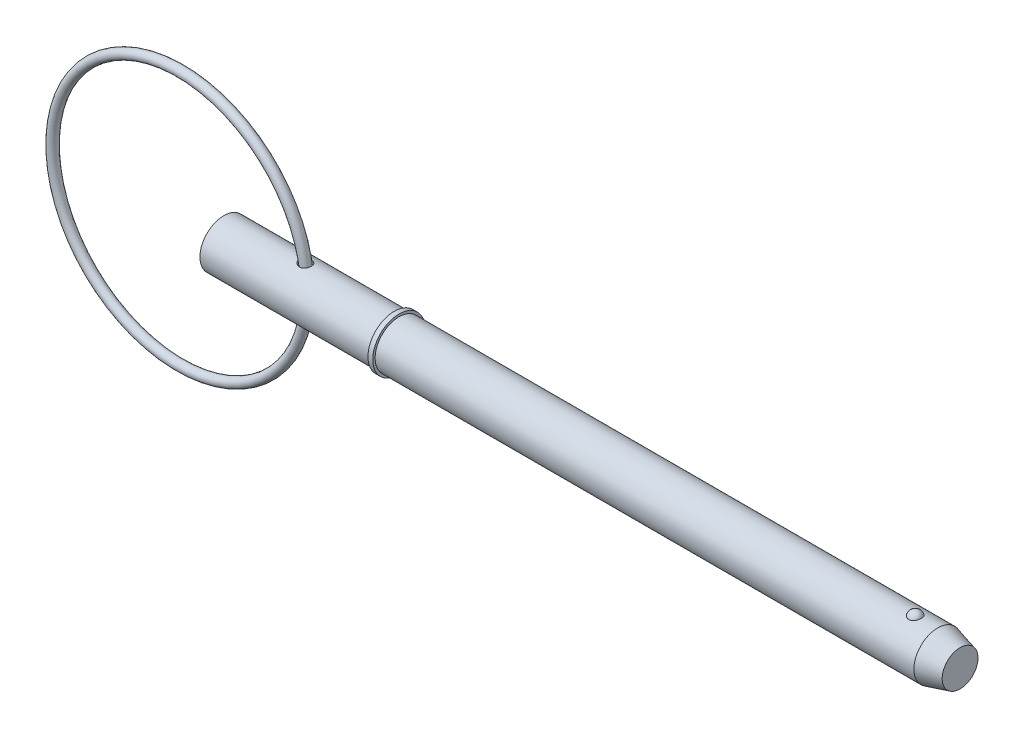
ISO-10303-21;
HEADER;
FILE_DESCRIPTION(('STEP AP214'),'2;1');
FILE_NAME('part.step','',(''),(''),'','','');
FILE_SCHEMA(('AUTOMOTIVE_DESIGN { 1 0 10303 214 1 1 1 1 }'));
ENDSEC;
DATA;
#1=APPLICATION_CONTEXT('core data for automotive mechanical design processes');
#2=APPLICATION_PROTOCOL_DEFINITION('international standard','automotive_design',2000,#1);
#3=PRODUCT_CONTEXT('',#1,'mechanical');
#4=PRODUCT('Part','Part','',(#3));
#5=PRODUCT_RELATED_PRODUCT_CATEGORY('part','',(#4));
#6=PRODUCT_DEFINITION_FORMATION('','',#4);
#7=PRODUCT_DEFINITION_CONTEXT('part definition',#1,'design');
#8=PRODUCT_DEFINITION('design','',#6,#7);
#9=PRODUCT_DEFINITION_SHAPE('','',#8);
#10=(LENGTH_UNIT() NAMED_UNIT(*) SI_UNIT(.MILLI.,.METRE.));
#11=(NAMED_UNIT(*) PLANE_ANGLE_UNIT() SI_UNIT($,.RADIAN.));
#12=(NAMED_UNIT(*) SI_UNIT($,.STERADIAN.) SOLID_ANGLE_UNIT());
#13=UNCERTAINTY_MEASURE_WITH_UNIT(LENGTH_MEASURE(1.E-05),#10,'distance_accuracy_value','');
#14=(GEOMETRIC_REPRESENTATION_CONTEXT(3) GLOBAL_UNCERTAINTY_ASSIGNED_CONTEXT((#13)) GLOBAL_UNIT_ASSIGNED_CONTEXT((#10,
#11,#12)) REPRESENTATION_CONTEXT('',''));
#15=CARTESIAN_POINT('',(0.,0.,0.));
#16=DIRECTION('',(0.,0.,1.));
#17=DIRECTION('',(1.,0.,0.));
#18=AXIS2_PLACEMENT_3D('',#15,#16,#17);
#19=CARTESIAN_POINT('',(-4.3552379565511,0.,0.));
#20=DIRECTION('',(0.,0.,1.));
#21=DIRECTION('',(1.,0.,0.));
#22=AXIS2_PLACEMENT_3D('',#19,#20,#21);
#23=TOROIDAL_SURFACE('',#22,12.7,0.476000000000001);
#24=CARTESIAN_POINT('',(8.8207620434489,0.,0.));
#25=VERTEX_POINT('',#24);
#26=VERTEX_LOOP('',#25);
#27=FACE_BOUND('',#26,.T.);
#28=ADVANCED_FACE('P0_F12',(#27),#23,.T.);
#29=CLOSED_SHELL('',(#28));
#30=MANIFOLD_SOLID_BREP('P0_B1',#29);
#31=CARTESIAN_POINT('',(0.,0.,0.));
#32=DIRECTION('',(1.,0.,0.));
#33=DIRECTION('',(0.,0.,-1.));
#34=AXIS2_PLACEMENT_3D('',#31,#32,#33);
#35=CYLINDRICAL_SURFACE('',#34,2.38);
#36=CARTESIAN_POINT('',(7.58975148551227,2.36313886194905,-0.28279801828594));
#37=CARTESIAN_POINT('',(7.6071494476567,2.3595137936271,-0.313086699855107));
#38=CARTESIAN_POINT('',(7.62722970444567,2.35548219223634,-0.341811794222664));
#39=CARTESIAN_POINT('',(7.6719764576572,2.34708028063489,-0.395416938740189));
#40=CARTESIAN_POINT('',(7.69665038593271,2.34270942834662,-0.420290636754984));
#41=CARTESIAN_POINT('',(7.74972661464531,2.33413422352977,-0.465561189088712));
#42=CARTESIAN_POINT('',(7.77811964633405,2.3299294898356,-0.485968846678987));
#43=CARTESIAN_POINT('',(7.83790446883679,2.32214293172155,-0.521911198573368));
#44=CARTESIAN_POINT('',(7.86929545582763,2.31856094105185,-0.537447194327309));
#45=CARTESIAN_POINT('',(7.93519088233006,2.31234960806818,-0.563583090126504));
#46=CARTESIAN_POINT('',(7.96975762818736,2.30974952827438,-0.574033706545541));
#47=CARTESIAN_POINT('',(8.04024488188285,2.3060008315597,-0.588914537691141));
#48=CARTESIAN_POINT('',(8.07616512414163,2.3048519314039,-0.593345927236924));
#49=CARTESIAN_POINT('',(8.14695871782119,2.30420789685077,-0.595841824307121));
#50=CARTESIAN_POINT('',(8.18182355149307,2.30465507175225,-0.594128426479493));
#51=CARTESIAN_POINT('',(8.25068512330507,2.30705630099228,-0.584734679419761));
#52=CARTESIAN_POINT('',(8.28468213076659,2.30900988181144,-0.577056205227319));
#53=CARTESIAN_POINT('',(8.34906698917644,2.31406811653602,-0.556412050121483));
#54=CARTESIAN_POINT('',(8.37955021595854,2.31711087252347,-0.543727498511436));
#55=CARTESIAN_POINT('',(8.43786372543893,2.32400968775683,-0.513438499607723));
#56=CARTESIAN_POINT('',(8.46569411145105,2.32786571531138,-0.495834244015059));
#57=CARTESIAN_POINT('',(8.51768626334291,2.33591620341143,-0.456393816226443));
#58=CARTESIAN_POINT('',(8.54188060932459,2.34010706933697,-0.434599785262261));
#59=CARTESIAN_POINT('',(8.58630752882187,2.34840208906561,-0.387277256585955));
#60=CARTESIAN_POINT('',(8.60653982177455,2.35250623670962,-0.361748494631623));
#61=CARTESIAN_POINT('',(8.64282785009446,2.36024850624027,-0.307237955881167));
#62=CARTESIAN_POINT('',(8.65881497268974,2.36387854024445,-0.278209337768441));
#63=CARTESIAN_POINT('',(8.68580879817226,2.37020506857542,-0.217827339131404));
#64=CARTESIAN_POINT('',(8.69681534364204,2.37290153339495,-0.18647388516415));
#65=CARTESIAN_POINT('',(8.71363969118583,2.37708738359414,-0.122079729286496));
#66=CARTESIAN_POINT('',(8.71941899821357,2.37856780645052,-0.0890283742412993));
#67=CARTESIAN_POINT('',(8.72550469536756,2.38012793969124,-0.0223933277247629));
#68=CARTESIAN_POINT('',(8.72581115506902,2.38020766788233,0.0111903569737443));
#69=CARTESIAN_POINT('',(8.72094957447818,2.37895941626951,0.0778527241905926));
#70=CARTESIAN_POINT('',(8.71579439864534,2.377634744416,0.110932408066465));
#71=CARTESIAN_POINT('',(8.70015845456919,2.37372548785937,0.175731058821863));
#72=CARTESIAN_POINT('',(8.68967753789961,2.37114086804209,0.207449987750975));
#73=CARTESIAN_POINT('',(8.66363496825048,2.36498751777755,0.268667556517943));
#74=CARTESIAN_POINT('',(8.64806773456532,2.36141770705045,0.298163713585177));
#75=CARTESIAN_POINT('',(8.61223946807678,2.35368505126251,0.354067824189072));
#76=CARTESIAN_POINT('',(8.59197833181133,2.34952219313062,0.380475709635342));
#77=CARTESIAN_POINT('',(8.54726357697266,2.34106443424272,0.429460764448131));
#78=CARTESIAN_POINT('',(8.52280850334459,2.33676948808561,0.452036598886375));
#79=CARTESIAN_POINT('',(8.47035669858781,2.3285376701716,0.49269040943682));
#80=CARTESIAN_POINT('',(8.44236041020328,2.32460075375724,0.510768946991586));
#81=CARTESIAN_POINT('',(8.38398546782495,2.31758529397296,0.541708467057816));
#82=CARTESIAN_POINT('',(8.35364184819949,2.31449641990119,0.554633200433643));
#83=CARTESIAN_POINT('',(8.29114127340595,2.30945817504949,0.575253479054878));
#84=CARTESIAN_POINT('',(8.25898451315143,2.30750868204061,0.582949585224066));
#85=CARTESIAN_POINT('',(8.19412910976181,2.30496641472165,0.592921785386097));
#86=CARTESIAN_POINT('',(8.161439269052,2.30436008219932,0.595252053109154));
#87=CARTESIAN_POINT('',(8.09610955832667,2.30450130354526,0.594704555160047));
#88=CARTESIAN_POINT('',(8.0634696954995,2.30524903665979,0.591826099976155));
#89=CARTESIAN_POINT('',(7.99825736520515,2.30802121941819,0.580921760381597));
#90=CARTESIAN_POINT('',(7.96570822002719,2.31007800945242,0.572765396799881));
#91=CARTESIAN_POINT('',(7.90235775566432,2.31524655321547,0.551500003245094));
#92=CARTESIAN_POINT('',(7.87155698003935,2.31835863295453,0.53838944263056));
#93=CARTESIAN_POINT('',(7.81084906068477,2.32548378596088,0.506755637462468));
#94=CARTESIAN_POINT('',(7.78107737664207,2.32953608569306,0.487980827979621));
#95=CARTESIAN_POINT('',(7.72506412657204,2.33797565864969,0.445793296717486));
#96=CARTESIAN_POINT('',(7.69882353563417,2.34236302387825,0.422379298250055));
#97=CARTESIAN_POINT('',(7.65019002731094,2.35106473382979,0.370927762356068));
#98=CARTESIAN_POINT('',(7.62788209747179,2.35537598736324,0.342808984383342));
#99=CARTESIAN_POINT('',(7.58861130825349,2.36331071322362,0.282967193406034));
#100=CARTESIAN_POINT('',(7.57164595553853,2.3669345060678,0.251245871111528));
#101=CARTESIAN_POINT('',(7.54465876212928,2.37284705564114,0.187017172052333));
#102=CARTESIAN_POINT('',(7.5342924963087,2.37520082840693,0.154660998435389));
#103=CARTESIAN_POINT('',(7.51954252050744,2.37858198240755,0.0885446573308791));
#104=CARTESIAN_POINT('',(7.51515589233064,2.37961001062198,0.0547851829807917));
#105=CARTESIAN_POINT('',(7.51270681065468,2.38018226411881,-0.0102367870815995));
#106=CARTESIAN_POINT('',(7.51416323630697,2.37983937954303,-0.0414812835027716));
#107=CARTESIAN_POINT('',(7.52225907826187,2.37796025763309,-0.103234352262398));
#108=CARTESIAN_POINT('',(7.52889419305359,2.37642501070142,-0.133743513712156));
#109=CARTESIAN_POINT('',(7.54430841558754,2.37294751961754,-0.184277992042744));
#110=CARTESIAN_POINT('',(7.55185254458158,2.37126438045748,-0.204709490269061));
#111=CARTESIAN_POINT('',(7.56916989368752,2.36748607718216,-0.244561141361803));
#112=CARTESIAN_POINT('',(7.57894307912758,2.36539091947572,-0.263981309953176));
#113=CARTESIAN_POINT('',(7.58975148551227,2.36313886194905,-0.28279801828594));
#114=B_SPLINE_CURVE_WITH_KNOTS('',3,(#36,#37,#38,#39,#40,#41,#42,#43,#44,#45,#46,#47,#48,#49,
#50,#51,#52,#53,#54,#55,#56,#57,#58,#59,#60,#61,#62,#63,#64,#65,#66,#67,#68,#69,#70,#71,#72,#73,
#74,#75,#76,#77,#78,#79,#80,#81,#82,#83,#84,#85,#86,#87,#88,#89,#90,#91,#92,#93,#94,#95,#96,#97,
#98,#99,#100,#101,#102,#103,#104,#105,#106,#107,#108,#109,#110,#111,#112,#113),.UNSPECIFIED.,
.T.,.F.,(4,2,2,2,2,2,2,2,2,2,2,2,2,2,2,2,2,2,2,2,2,2,2,2,2,2,2,2,2,2,2,2,2,2,2,2,2,2,4),(0.,
0.105267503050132,0.210706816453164,0.315888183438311,0.421041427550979,0.529118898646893,
0.637175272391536,0.741366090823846,0.84552417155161,0.944516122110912,1.04350421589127,
1.14154435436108,1.23959143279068,1.33913812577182,1.43868796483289,1.53896508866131,
1.63924093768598,1.73928111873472,1.83932408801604,1.93947719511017,2.03963250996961,
2.13982264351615,2.24000026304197,2.33889712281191,2.43778337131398,2.53566679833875,
2.63356318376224,2.73397729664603,2.83442245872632,2.94022921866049,3.04606513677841,
3.15396441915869,3.26181327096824,3.36343346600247,3.46500405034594,3.55839004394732,
3.65169855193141,3.71709653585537,3.78249350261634),.UNSPECIFIED.);
#115=CARTESIAN_POINT('',(7.58975148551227,2.36313886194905,-0.28279801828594));
#116=VERTEX_POINT('',#115);
#117=EDGE_CURVE('P1_E42',#116,#116,#114,.T.);
#118=ORIENTED_EDGE('',*,*,#117,.T.);
#119=EDGE_LOOP('',(#118));
#120=FACE_BOUND('',#119,.T.);
#121=CARTESIAN_POINT('',(0.,0.,0.));
#122=DIRECTION('',(1.,0.,0.));
#123=DIRECTION('',(0.,0.,-1.));
#124=AXIS2_PLACEMENT_3D('',#121,#122,#123);
#125=CIRCLE('',#124,2.38);
#126=CARTESIAN_POINT('',(0.,0.,-2.38));
#127=VERTEX_POINT('',#126);
#128=EDGE_CURVE('P1_E9',#127,#127,#125,.T.);
#129=ORIENTED_EDGE('',*,*,#128,.T.);
#130=EDGE_LOOP('',(#129));
#131=FACE_BOUND('',#130,.T.);
#132=CARTESIAN_POINT('',(16.974,0.,0.));
#133=DIRECTION('',(1.,0.,0.));
#134=DIRECTION('',(0.,0.,-1.));
#135=AXIS2_PLACEMENT_3D('',#132,#133,#134);
#136=CIRCLE('',#135,2.38);
#137=CARTESIAN_POINT('',(16.974,0.,-2.38));
#138=VERTEX_POINT('',#137);
#139=EDGE_CURVE('P1_E25',#138,#138,#136,.T.);
#140=ORIENTED_EDGE('',*,*,#139,.F.);
#141=EDGE_LOOP('',(#140));
#142=FACE_BOUND('',#141,.T.);
#143=CARTESIAN_POINT('',(7.58975148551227,-2.36313886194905,-0.28279801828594));
#144=CARTESIAN_POINT('',(7.57418830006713,-2.3663814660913,-0.255701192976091));
#145=CARTESIAN_POINT('',(7.56076205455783,-2.36930044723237,-0.227336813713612));
#146=CARTESIAN_POINT('',(7.53869583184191,-2.37419355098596,-0.168724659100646));
#147=CARTESIAN_POINT('',(7.53005409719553,-2.37616802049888,-0.138477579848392));
#148=CARTESIAN_POINT('',(7.5179268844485,-2.37895970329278,-0.0768369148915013));
#149=CARTESIAN_POINT('',(7.51445304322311,-2.37977430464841,-0.0454409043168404));
#150=CARTESIAN_POINT('',(7.51287156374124,-2.38014365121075,0.0174935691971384));
#151=CARTESIAN_POINT('',(7.51476360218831,-2.37969847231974,0.0490320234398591));
#152=CARTESIAN_POINT('',(7.52368198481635,-2.37763188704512,0.11036883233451));
#153=CARTESIAN_POINT('',(7.53055435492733,-2.37604576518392,0.140191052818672));
#154=CARTESIAN_POINT('',(7.54895588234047,-2.37190466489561,0.19828599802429));
#155=CARTESIAN_POINT('',(7.56048572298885,-2.36934954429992,0.226558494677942));
#156=CARTESIAN_POINT('',(7.58819257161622,-2.36343089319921,0.281762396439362));
#157=CARTESIAN_POINT('',(7.60450508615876,-2.36004434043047,0.308623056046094));
#158=CARTESIAN_POINT('',(7.64106334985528,-2.35283977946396,0.359451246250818));
#159=CARTESIAN_POINT('',(7.6613104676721,-2.34902162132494,0.383417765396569));
#160=CARTESIAN_POINT('',(7.70695754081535,-2.34099193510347,0.429832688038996));
#161=CARTESIAN_POINT('',(7.73264232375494,-2.33677362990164,0.45200004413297));
#162=CARTESIAN_POINT('',(7.78725305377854,-2.32868304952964,0.491988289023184));
#163=CARTESIAN_POINT('',(7.81618023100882,-2.32481090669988,0.509807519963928));
#164=CARTESIAN_POINT('',(7.87824201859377,-2.31763132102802,0.541539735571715));
#165=CARTESIAN_POINT('',(7.91152093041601,-2.31436703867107,0.555181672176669));
#166=CARTESIAN_POINT('',(7.97999150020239,-2.30909873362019,0.576703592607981));
#167=CARTESIAN_POINT('',(8.01518292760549,-2.30709455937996,0.584584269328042));
#168=CARTESIAN_POINT('',(8.08580757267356,-2.30465743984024,0.594119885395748));
#169=CARTESIAN_POINT('',(8.12122470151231,-2.30419653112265,0.595885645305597));
#170=CARTESIAN_POINT('',(8.19181659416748,-2.30486796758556,0.593284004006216));
#171=CARTESIAN_POINT('',(8.22699144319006,-2.30599972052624,0.588918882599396));
#172=CARTESIAN_POINT('',(8.29408987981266,-2.30963941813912,0.574470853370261));
#173=CARTESIAN_POINT('',(8.32608666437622,-2.31207030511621,0.564707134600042));
#174=CARTESIAN_POINT('',(8.38787213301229,-2.31798180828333,0.539927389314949));
#175=CARTESIAN_POINT('',(8.41766103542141,-2.32146232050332,0.524911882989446));
#176=CARTESIAN_POINT('',(8.47353661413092,-2.32898511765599,0.490439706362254));
#177=CARTESIAN_POINT('',(8.49969091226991,-2.33301318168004,0.471089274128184));
#178=CARTESIAN_POINT('',(8.54838372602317,-2.34124455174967,0.428307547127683));
#179=CARTESIAN_POINT('',(8.57092204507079,-2.34544786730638,0.404876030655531));
#180=CARTESIAN_POINT('',(8.61207557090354,-2.35362667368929,0.354267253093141));
#181=CARTESIAN_POINT('',(8.63063940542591,-2.35759874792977,0.3270476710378));
#182=CARTESIAN_POINT('',(8.66303816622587,-2.36482918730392,0.269839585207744));
#183=CARTESIAN_POINT('',(8.67687284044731,-2.36808751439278,0.23985093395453));
#184=CARTESIAN_POINT('',(8.69960621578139,-2.37357381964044,0.177579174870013));
#185=CARTESIAN_POINT('',(8.7084473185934,-2.3757897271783,0.145273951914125));
#186=CARTESIAN_POINT('',(8.72072898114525,-2.37889592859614,0.0795911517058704));
#187=CARTESIAN_POINT('',(8.72416959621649,-2.37978623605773,0.0462135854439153));
#188=CARTESIAN_POINT('',(8.72556332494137,-2.38014500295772,-0.0206284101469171));
#189=CARTESIAN_POINT('',(8.72352221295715,-2.37961495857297,-0.0540927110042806));
#190=CARTESIAN_POINT('',(8.71401607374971,-2.37719332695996,-0.12019135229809));
#191=CARTESIAN_POINT('',(8.70655097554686,-2.37530172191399,-0.152825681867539));
#192=CARTESIAN_POINT('',(8.68638818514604,-2.37036240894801,-0.216324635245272));
#193=CARTESIAN_POINT('',(8.67369312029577,-2.36731528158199,-0.247190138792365));
#194=CARTESIAN_POINT('',(8.64338307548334,-2.36039503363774,-0.306303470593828));
#195=CARTESIAN_POINT('',(8.62576790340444,-2.35652188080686,-0.334551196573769));
#196=CARTESIAN_POINT('',(8.58601062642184,-2.34836581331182,-0.387689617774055));
#197=CARTESIAN_POINT('',(8.56385884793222,-2.34408203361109,-0.412572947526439));
#198=CARTESIAN_POINT('',(8.51562034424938,-2.33559361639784,-0.458194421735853));
#199=CARTESIAN_POINT('',(8.4895339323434,-2.33138897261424,-0.478932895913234));
#200=CARTESIAN_POINT('',(8.43437902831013,-2.32357677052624,-0.515498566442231));
#201=CARTESIAN_POINT('',(8.40533919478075,-2.31996422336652,-0.531367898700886));
#202=CARTESIAN_POINT('',(8.3449114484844,-2.31370413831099,-0.557997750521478));
#203=CARTESIAN_POINT('',(8.31352388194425,-2.31105645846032,-0.568759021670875));
#204=CARTESIAN_POINT('',(8.24979053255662,-2.30704987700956,-0.584798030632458));
#205=CARTESIAN_POINT('',(8.2174653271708,-2.30567279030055,-0.590153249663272));
#206=CARTESIAN_POINT('',(8.15234941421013,-2.3042717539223,-0.595600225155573));
#207=CARTESIAN_POINT('',(8.11955868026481,-2.30424788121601,-0.595691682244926));
#208=CARTESIAN_POINT('',(8.05396041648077,-2.30553291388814,-0.590698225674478));
#209=CARTESIAN_POINT('',(8.02115865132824,-2.30685983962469,-0.585543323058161));
#210=CARTESIAN_POINT('',(7.95682322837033,-2.31069752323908,-0.570209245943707));
#211=CARTESIAN_POINT('',(7.9252899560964,-2.31320863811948,-0.560028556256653));
#212=CARTESIAN_POINT('',(7.86270639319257,-2.31927991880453,-0.534343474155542));
#213=CARTESIAN_POINT('',(7.83175966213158,-2.32288638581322,-0.51859766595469));
#214=CARTESIAN_POINT('',(7.7728658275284,-2.33068292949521,-0.48234820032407));
#215=CARTESIAN_POINT('',(7.74491930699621,-2.33487311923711,-0.461843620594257));
#216=CARTESIAN_POINT('',(7.69322838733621,-2.34330635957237,-0.416926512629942));
#217=CARTESIAN_POINT('',(7.66941974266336,-2.34754724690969,-0.392587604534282));
#218=CARTESIAN_POINT('',(7.62614930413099,-2.35569931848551,-0.340264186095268));
#219=CARTESIAN_POINT('',(7.60668542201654,-2.35961066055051,-0.312281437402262));
#220=CARTESIAN_POINT('',(7.58975148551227,-2.36313886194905,-0.28279801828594));
#221=B_SPLINE_CURVE_WITH_KNOTS('',3,(#143,#144,#145,#146,#147,#148,#149,#150,#151,#152,#153,
#154,#155,#156,#157,#158,#159,#160,#161,#162,#163,#164,#165,#166,#167,#168,#169,#170,#171,#172,
#173,#174,#175,#176,#177,#178,#179,#180,#181,#182,#183,#184,#185,#186,#187,#188,#189,#190,#191,
#192,#193,#194,#195,#196,#197,#198,#199,#200,#201,#202,#203,#204,#205,#206,#207,#208,#209,#210,
#211,#212,#213,#214,#215,#216,#217,#218,#219,#220),.UNSPECIFIED.,.T.,.F.,(4,2,2,2,2,2,2,2,2,2,2,
2,2,2,2,2,2,2,2,2,2,2,2,2,2,2,2,2,2,2,2,2,2,2,2,2,2,2,4),(0.,0.0941407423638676,
0.188246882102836,0.282564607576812,0.376876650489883,0.468390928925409,0.559918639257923,
0.654342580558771,0.748799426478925,0.850921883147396,0.953083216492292,1.06090345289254,
1.16871071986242,1.2745536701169,1.38035727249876,1.48048681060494,1.58060643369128,
1.67849861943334,1.7763961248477,1.87549138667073,1.97459192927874,2.07481335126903,
2.17503374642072,2.27514861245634,2.37526478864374,2.47533073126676,2.57540058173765,
2.67568607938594,2.77596359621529,2.87534713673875,2.97471604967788,3.07263964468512,
3.17056880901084,3.26982174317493,3.36910461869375,3.47336737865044,3.57765036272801,
3.68013205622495,3.78256438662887),.UNSPECIFIED.);
#222=CARTESIAN_POINT('',(7.58975148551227,-2.36313886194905,-0.28279801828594));
#223=VERTEX_POINT('',#222);
#224=EDGE_CURVE('P1_E17',#223,#223,#221,.T.);
#225=ORIENTED_EDGE('',*,*,#224,.T.);
#226=EDGE_LOOP('',(#225));
#227=FACE_BOUND('',#226,.T.);
#228=ADVANCED_FACE('P1_F13',(#120,#131,#142,#227),#35,.T.);
#229=CARTESIAN_POINT('',(0.,0.,0.));
#230=DIRECTION('',(1.,0.,0.));
#231=DIRECTION('',(0.,0.,-1.));
#232=AXIS2_PLACEMENT_3D('',#229,#230,#231);
#233=CYLINDRICAL_SURFACE('',#232,2.38);
#234=CARTESIAN_POINT('',(71.1094297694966,0.,0.));
#235=DIRECTION('',(1.,0.,0.));
#236=DIRECTION('',(0.,0.,-1.));
#237=AXIS2_PLACEMENT_3D('',#234,#235,#236);
#238=CIRCLE('',#237,2.38);
#239=CARTESIAN_POINT('',(71.1094297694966,0.,-2.38));
#240=VERTEX_POINT('',#239);
#241=EDGE_CURVE('P1_E99',#240,#240,#238,.T.);
#242=ORIENTED_EDGE('',*,*,#241,.F.);
#243=EDGE_LOOP('',(#242));
#244=FACE_BOUND('',#243,.T.);
#245=CARTESIAN_POINT('',(17.45,0.,0.));
#246=DIRECTION('',(1.,0.,0.));
#247=DIRECTION('',(0.,0.,-1.));
#248=AXIS2_PLACEMENT_3D('',#245,#246,#247);
#249=CIRCLE('',#248,2.38);
#250=CARTESIAN_POINT('',(17.45,0.,-2.38));
#251=VERTEX_POINT('',#250);
#252=EDGE_CURVE('P1_E96',#251,#251,#249,.T.);
#253=ORIENTED_EDGE('',*,*,#252,.T.);
#254=EDGE_LOOP('',(#253));
#255=FACE_BOUND('',#254,.T.);
#256=CARTESIAN_POINT('',(68.8634492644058,2.2921568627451,0.640637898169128));
#257=CARTESIAN_POINT('',(68.8303559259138,2.29215737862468,0.640637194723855));
#258=CARTESIAN_POINT('',(68.7972546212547,2.29293179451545,0.637884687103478));
#259=CARTESIAN_POINT('',(68.7320176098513,2.29594030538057,0.62696820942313));
#260=CARTESIAN_POINT('',(68.6998823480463,2.29817506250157,0.618801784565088));
#261=CARTESIAN_POINT('',(68.6375402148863,2.30384308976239,0.597351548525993));
#262=CARTESIAN_POINT('',(68.6073305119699,2.30727454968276,0.584075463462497));
#263=CARTESIAN_POINT('',(68.5495674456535,2.31495941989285,0.552829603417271));
#264=CARTESIAN_POINT('',(68.5220141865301,2.31921286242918,0.534859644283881));
#265=CARTESIAN_POINT('',(68.4695938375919,2.32820213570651,0.494282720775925));
#266=CARTESIAN_POINT('',(68.4448050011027,2.33294694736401,0.471576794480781));
#267=CARTESIAN_POINT('',(68.3992169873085,2.34234144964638,0.422446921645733));
#268=CARTESIAN_POINT('',(68.3784185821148,2.34699112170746,0.396022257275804));
#269=CARTESIAN_POINT('',(68.3403580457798,2.35593942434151,0.338855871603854));
#270=CARTESIAN_POINT('',(68.3233051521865,2.36021170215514,0.30797060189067));
#271=CARTESIAN_POINT('',(68.2943607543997,2.3677057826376,0.24375057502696));
#272=CARTESIAN_POINT('',(68.2824701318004,2.37092740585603,0.210415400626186));
#273=CARTESIAN_POINT('',(68.2638076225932,2.37606901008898,0.141189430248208));
#274=CARTESIAN_POINT('',(68.2571956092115,2.37794816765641,0.105252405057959));
#275=CARTESIAN_POINT('',(68.2498095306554,2.38005135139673,0.0327351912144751));
#276=CARTESIAN_POINT('',(68.2490358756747,2.38027526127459,-0.00384504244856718));
#277=CARTESIAN_POINT('',(68.2533628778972,2.37903842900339,-0.0769838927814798));
#278=CARTESIAN_POINT('',(68.2585202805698,2.37756141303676,-0.11353889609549));
#279=CARTESIAN_POINT('',(68.2747013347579,2.37305303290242,-0.185229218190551));
#280=CARTESIAN_POINT('',(68.2857251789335,2.37002161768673,-0.220364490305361));
#281=CARTESIAN_POINT('',(68.3133977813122,2.36273722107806,-0.288156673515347));
#282=CARTESIAN_POINT('',(68.3300389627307,2.35848588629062,-0.320816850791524));
#283=CARTESIAN_POINT('',(68.3685984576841,2.34923130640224,-0.38274468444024));
#284=CARTESIAN_POINT('',(68.390516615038,2.34422808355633,-0.412012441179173));
#285=CARTESIAN_POINT('',(68.4387549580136,2.33412555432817,-0.465830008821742));
#286=CARTESIAN_POINT('',(68.465002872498,2.32902887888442,-0.490444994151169));
#287=CARTESIAN_POINT('',(68.5214769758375,2.31926941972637,-0.5347003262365));
#288=CARTESIAN_POINT('',(68.551702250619,2.3146065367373,-0.554341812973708));
#289=CARTESIAN_POINT('',(68.6140618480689,2.30645675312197,-0.587312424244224));
#290=CARTESIAN_POINT('',(68.6460780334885,2.30293152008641,-0.600855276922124));
#291=CARTESIAN_POINT('',(68.7120795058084,2.29725171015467,-0.62222045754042));
#292=CARTESIAN_POINT('',(68.7460641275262,2.29509667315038,-0.630044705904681));
#293=CARTESIAN_POINT('',(68.813299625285,2.29249264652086,-0.639452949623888));
#294=CARTESIAN_POINT('',(68.8465087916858,2.29196755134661,-0.641315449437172));
#295=CARTESIAN_POINT('',(68.912763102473,2.29246849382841,-0.639522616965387));
#296=CARTESIAN_POINT('',(68.9458082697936,2.29349430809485,-0.635868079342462));
#297=CARTESIAN_POINT('',(69.0101025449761,2.29694059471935,-0.623301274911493));
#298=CARTESIAN_POINT('',(69.0413744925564,2.29933234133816,-0.614497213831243));
#299=CARTESIAN_POINT('',(69.1019952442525,2.30522511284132,-0.592006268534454));
#300=CARTESIAN_POINT('',(69.1313438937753,2.30872622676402,-0.578318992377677));
#301=CARTESIAN_POINT('',(69.1880369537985,2.31655795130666,-0.546112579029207));
#302=CARTESIAN_POINT('',(69.215320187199,2.32090569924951,-0.527490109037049));
#303=CARTESIAN_POINT('',(69.2664904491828,2.32992206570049,-0.486117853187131));
#304=CARTESIAN_POINT('',(69.2903767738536,2.33459075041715,-0.46336721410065));
#305=CARTESIAN_POINT('',(69.3352722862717,2.34399834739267,-0.413220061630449));
#306=CARTESIAN_POINT('',(69.3560972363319,2.34873051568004,-0.385657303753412));
#307=CARTESIAN_POINT('',(69.393056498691,2.35754932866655,-0.327455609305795));
#308=CARTESIAN_POINT('',(69.4091898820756,2.36163584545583,-0.296816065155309));
#309=CARTESIAN_POINT('',(69.4369822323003,2.36889321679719,-0.232047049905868));
#310=CARTESIAN_POINT('',(69.4484450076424,2.37202275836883,-0.19782862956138));
#311=CARTESIAN_POINT('',(69.4657523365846,2.37681926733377,-0.127900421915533));
#312=CARTESIAN_POINT('',(69.4715962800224,2.37848607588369,-0.0921904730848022));
#313=CARTESIAN_POINT('',(69.477605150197,2.38020024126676,-0.0196348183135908));
#314=CARTESIAN_POINT('',(69.4776704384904,2.38021918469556,0.017219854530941));
#315=CARTESIAN_POINT('',(69.4718689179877,2.37856356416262,0.0904219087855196));
#316=CARTESIAN_POINT('',(69.4660018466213,2.37688892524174,0.126769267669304));
#317=CARTESIAN_POINT('',(69.448425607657,2.37201688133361,0.198028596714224));
#318=CARTESIAN_POINT('',(69.436699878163,2.36881516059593,0.232936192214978));
#319=CARTESIAN_POINT('',(69.4076354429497,2.36123444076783,0.300196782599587));
#320=CARTESIAN_POINT('',(69.3902967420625,2.3568554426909,0.332549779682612));
#321=CARTESIAN_POINT('',(69.3505350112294,2.34744667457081,0.393495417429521));
#322=CARTESIAN_POINT('',(69.3281528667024,2.34242227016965,0.422115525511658));
#323=CARTESIAN_POINT('',(69.2787391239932,2.33227293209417,0.475004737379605));
#324=CARTESIAN_POINT('',(69.2517076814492,2.32714800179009,0.499273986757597));
#325=CARTESIAN_POINT('',(69.1944988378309,2.31755359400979,0.54204602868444));
#326=CARTESIAN_POINT('',(69.1644297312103,2.31306986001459,0.560690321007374));
#327=CARTESIAN_POINT('',(69.1013869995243,2.3051412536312,0.592447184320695));
#328=CARTESIAN_POINT('',(69.0684158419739,2.30169550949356,0.605564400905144));
#329=CARTESIAN_POINT('',(69.0068424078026,2.29677744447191,0.623927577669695));
#330=CARTESIAN_POINT('',(68.9785555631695,2.29505839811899,0.63017893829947));
#331=CARTESIAN_POINT('',(68.9213308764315,2.29274795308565,0.638534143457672));
#332=CARTESIAN_POINT('',(68.8923931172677,2.29215641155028,0.64063851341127));
#333=CARTESIAN_POINT('',(68.8634492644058,2.2921568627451,0.640637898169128));
#334=B_SPLINE_CURVE_WITH_KNOTS('',3,(#256,#257,#258,#259,#260,#261,#262,#263,#264,#265,#266,
#267,#268,#269,#270,#271,#272,#273,#274,#275,#276,#277,#278,#279,#280,#281,#282,#283,#284,#285,
#286,#287,#288,#289,#290,#291,#292,#293,#294,#295,#296,#297,#298,#299,#300,#301,#302,#303,#304,
#305,#306,#307,#308,#309,#310,#311,#312,#313,#314,#315,#316,#317,#318,#319,#320,#321,#322,#323,
#324,#325,#326,#327,#328,#329,#330,#331,#332,#333),.UNSPECIFIED.,.T.,.F.,(4,2,2,2,2,2,2,2,2,2,2,
2,2,2,2,2,2,2,2,2,2,2,2,2,2,2,2,2,2,2,2,2,2,2,2,2,2,2,4),(0.,0.0991724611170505,
0.198389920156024,0.297457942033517,0.396529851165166,0.497927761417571,0.599345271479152,
0.705475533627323,0.811623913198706,0.920876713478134,1.03013718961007,1.1404517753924,
1.25076998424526,1.3609399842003,1.47110672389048,1.57959248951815,1.6880533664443,
1.79234266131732,1.89659691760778,1.99590391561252,2.0951966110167,2.19247425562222,
2.28975970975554,2.38926978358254,2.48880044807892,2.59293588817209,2.69709193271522,
2.80525821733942,2.91343624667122,3.02347917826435,3.13352698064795,3.24388765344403,
3.35424823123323,3.46374443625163,3.57323697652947,3.67968690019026,3.78604717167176,
3.87279565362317,3.9595331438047),.UNSPECIFIED.);
#335=CARTESIAN_POINT('',(68.8634492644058,2.2921568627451,0.640637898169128));
#336=VERTEX_POINT('',#335);
#337=EDGE_CURVE('P1_E34',#336,#336,#334,.T.);
#338=ORIENTED_EDGE('',*,*,#337,.T.);
#339=EDGE_LOOP('',(#338));
#340=FACE_BOUND('',#339,.T.);
#341=ADVANCED_FACE('P1_F46',(#244,#255,#340),#233,.T.);
#342=CARTESIAN_POINT('',(0.,0.,0.));
#343=DIRECTION('',(-1.,0.,0.));
#344=DIRECTION('',(0.,0.,1.));
#345=AXIS2_PLACEMENT_3D('',#342,#343,#344);
#346=PLANE('',#345);
#347=ORIENTED_EDGE('',*,*,#128,.F.);
#348=EDGE_LOOP('',(#347));
#349=FACE_BOUND('',#348,.T.);
#350=ADVANCED_FACE('P1_F15',(#349),#346,.T.);
#351=CARTESIAN_POINT('',(16.974,2.38,0.));
#352=DIRECTION('',(-1.,0.,0.));
#353=DIRECTION('',(0.,0.,1.));
#354=AXIS2_PLACEMENT_3D('',#351,#352,#353);
#355=PLANE('',#354);
#356=ORIENTED_EDGE('',*,*,#139,.T.);
#357=EDGE_LOOP('',(#356));
#358=FACE_BOUND('',#357,.T.);
#359=CARTESIAN_POINT('',(16.974,0.,0.));
#360=DIRECTION('',(1.,0.,0.));
#361=DIRECTION('',(0.,0.,-1.));
#362=AXIS2_PLACEMENT_3D('',#359,#360,#361);
#363=CIRCLE('',#362,2.618);
#364=CARTESIAN_POINT('',(16.974,0.,-2.618));
#365=VERTEX_POINT('',#364);
#366=EDGE_CURVE('P1_E30',#365,#365,#363,.T.);
#367=ORIENTED_EDGE('',*,*,#366,.F.);
#368=EDGE_LOOP('',(#367));
#369=FACE_BOUND('',#368,.T.);
#370=ADVANCED_FACE('P1_F81',(#358,#369),#355,.T.);
#371=CARTESIAN_POINT('',(0.,0.,0.));
#372=DIRECTION('',(1.,0.,0.));
#373=DIRECTION('',(0.,0.,-1.));
#374=AXIS2_PLACEMENT_3D('',#371,#372,#373);
#375=CYLINDRICAL_SURFACE('',#374,2.618);
#376=ORIENTED_EDGE('',*,*,#366,.T.);
#377=EDGE_LOOP('',(#376));
#378=FACE_BOUND('',#377,.T.);
#379=CARTESIAN_POINT('',(17.45,0.,0.));
#380=DIRECTION('',(1.,0.,0.));
#381=DIRECTION('',(0.,0.,-1.));
#382=AXIS2_PLACEMENT_3D('',#379,#380,#381);
#383=CIRCLE('',#382,2.618);
#384=CARTESIAN_POINT('',(17.45,0.,-2.618));
#385=VERTEX_POINT('',#384);
#386=EDGE_CURVE('P1_E95',#385,#385,#383,.T.);
#387=ORIENTED_EDGE('',*,*,#386,.F.);
#388=EDGE_LOOP('',(#387));
#389=FACE_BOUND('',#388,.T.);
#390=ADVANCED_FACE('P1_F68',(#378,#389),#375,.T.);
#391=CARTESIAN_POINT('',(17.45,2.618,0.));
#392=DIRECTION('',(1.,0.,0.));
#393=DIRECTION('',(0.,0.,-1.));
#394=AXIS2_PLACEMENT_3D('',#391,#392,#393);
#395=PLANE('',#394);
#396=ORIENTED_EDGE('',*,*,#386,.T.);
#397=EDGE_LOOP('',(#396));
#398=FACE_BOUND('',#397,.T.);
#399=ORIENTED_EDGE('',*,*,#252,.F.);
#400=EDGE_LOOP('',(#399));
#401=FACE_BOUND('',#400,.T.);
#402=ADVANCED_FACE('P1_F62',(#398,#401),#395,.T.);
#403=CARTESIAN_POINT('',(73.33,0.,0.));
#404=DIRECTION('',(-1.,0.,0.));
#405=DIRECTION('',(0.,0.,1.));
#406=AXIS2_PLACEMENT_3D('',#403,#404,#405);
#407=CONICAL_SURFACE('',#406,1.78500000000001,0.26179938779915);
#408=ORIENTED_EDGE('',*,*,#241,.T.);
#409=EDGE_LOOP('',(#408));
#410=FACE_BOUND('',#409,.T.);
#411=CARTESIAN_POINT('',(73.33,0.,0.));
#412=DIRECTION('',(1.,0.,0.));
#413=DIRECTION('',(0.,0.,-1.));
#414=AXIS2_PLACEMENT_3D('',#411,#412,#413);
#415=CIRCLE('',#414,1.78500000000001);
#416=CARTESIAN_POINT('',(73.33,0.,-1.78500000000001));
#417=VERTEX_POINT('',#416);
#418=EDGE_CURVE('P1_E41',#417,#417,#415,.T.);
#419=ORIENTED_EDGE('',*,*,#418,.F.);
#420=EDGE_LOOP('',(#419));
#421=FACE_BOUND('',#420,.T.);
#422=ADVANCED_FACE('P1_F59',(#410,#421),#407,.T.);
#423=CARTESIAN_POINT('',(73.33,1.78500000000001,0.));
#424=DIRECTION('',(1.,0.,0.));
#425=DIRECTION('',(0.,0.,-1.));
#426=AXIS2_PLACEMENT_3D('',#423,#424,#425);
#427=PLANE('',#426);
#428=ORIENTED_EDGE('',*,*,#418,.T.);
#429=EDGE_LOOP('',(#428));
#430=FACE_BOUND('',#429,.T.);
#431=ADVANCED_FACE('P1_F55',(#430),#427,.T.);
#432=CARTESIAN_POINT('',(68.8634492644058,2.142,0.));
#433=DIRECTION('',(-1.,0.,0.));
#434=DIRECTION('',(0.,1.,0.));
#435=AXIS2_PLACEMENT_3D('',#432,#433,#434);
#436=SPHERICAL_SURFACE('',#435,0.658000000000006);
#437=ORIENTED_EDGE('',*,*,#337,.F.);
#438=EDGE_LOOP('',(#437));
#439=FACE_BOUND('',#438,.T.);
#440=ADVANCED_FACE('P1_F50',(#439),#436,.T.);
#441=CARTESIAN_POINT('',(-4.3552379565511,0.,0.));
#442=DIRECTION('',(0.,0.,1.));
#443=DIRECTION('',(1.,0.,0.));
#444=AXIS2_PLACEMENT_3D('',#441,#442,#443);
#445=TOROIDAL_SURFACE('',#444,12.7,0.594999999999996);
#446=ORIENTED_EDGE('',*,*,#224,.F.);
#447=EDGE_LOOP('',(#446));
#448=FACE_BOUND('',#447,.T.);
#449=ORIENTED_EDGE('',*,*,#117,.F.);
#450=EDGE_LOOP('',(#449));
#451=FACE_BOUND('',#450,.T.);
#452=ADVANCED_FACE('P1_F54',(#448,#451),#445,.F.);
#453=CLOSED_SHELL('',(#228,#341,#350,#370,#390,#402,#422,#431,#440,#452));
#454=MANIFOLD_SOLID_BREP('P1_B1',#453);
#455=ADVANCED_BREP_SHAPE_REPRESENTATION('',(#18,#30,#454),#14);
#456=SHAPE_DEFINITION_REPRESENTATION(#9,#455);
ENDSEC;
END-ISO-10303-21;
